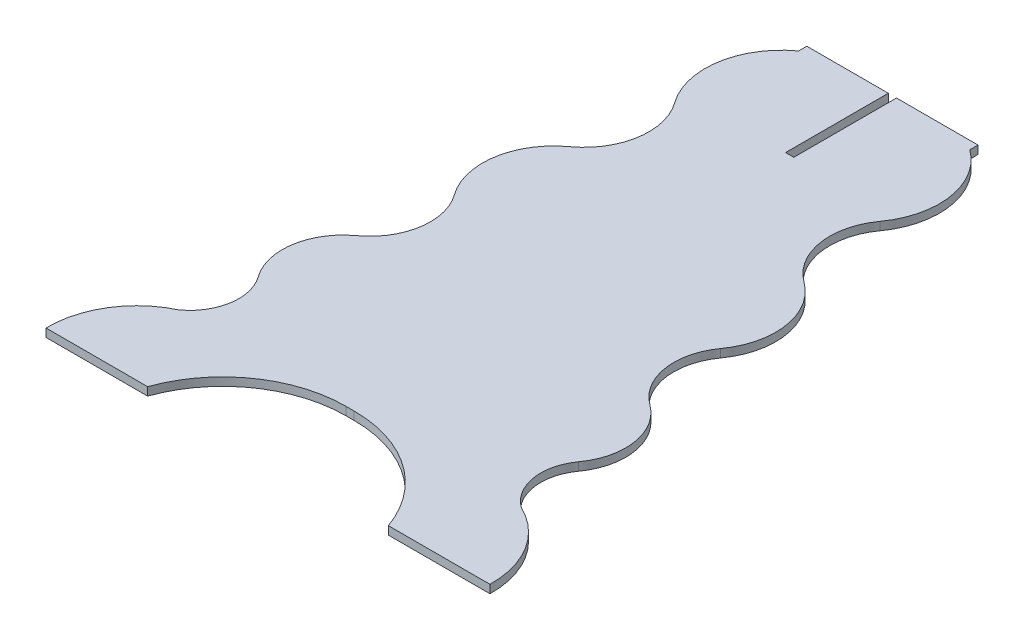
from build123d import *

# Parameters (mm, degrees)
BOSS_EXTRUDE1_DEPTH = 12
SKETCH2_W           = 12
SKETCH2_H           = 642
BOSS_EXTRUDE3_DEPTH = 12
SKETCH3_W           = 12
SKETCH3_H           = 150
CUT_EXTRUDE1_DEPTH  = 12


with BuildPart() as part:
    # Sketch1 → Boss-Extrude1 (new body)
    with BuildSketch(Plane(origin=(0, 0, 0), x_dir=(1, 0, 0), z_dir=(0, 1, 0))):
        with BuildLine():
            Line((6, 0), (6, 642))
            Line((6, 642), (-6, 642))
            Line((-6, 642), (-6, 0))
            ThreePointArc((-6, 0), (-109.965275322, -33.02760149), (-175.809051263, -120))
            Line((-175.809051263, -120), (-324.190948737, -120))
            ThreePointArc((-324.190948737, -120), (-304.755055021, -49.081824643), (-250, 0))
            ThreePointArc((-250, 0), (-221.324076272, 46.603663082), (-234.00090234, 99.8343694))
            ThreePointArc((-234.00090234, 99.8343694), (-249.721494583, 165.84602124), (-214.160345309, 223.639445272))
            ThreePointArc((-214.160345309, 223.639445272), (-178.815924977, 281.080644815), (-194.4407074, 346.689985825))
            ThreePointArc((-194.4407074, 346.689985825), (-212.852125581, 424.000567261), (-171.204127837, 491.686242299))
            ThreePointArc((-171.204127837, 491.686242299), (-133.187323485, 553.470558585), (-149.993492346, 624.040607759))
            ThreePointArc((-149.993492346, 624.040607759), (-169.796993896, 707.19662563), (-125, 780))
            Line((-125, 780), (-125, 792))
            Line((-125, 792), (125, 792))
            Line((125, 792), (125, 780))
            ThreePointArc((125, 780), (169.796993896, 707.19662563), (149.993492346, 624.040607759))
            ThreePointArc((149.993492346, 624.040607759), (133.187323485, 553.470558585), (171.204127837, 491.686242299))
            ThreePointArc((171.204127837, 491.686242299), (212.852125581, 424.000567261), (194.4407074, 346.689985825))
            ThreePointArc((194.4407074, 346.689985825), (178.815924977, 281.080644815), (214.160345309, 223.639445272))
            ThreePointArc((214.160345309, 223.639445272), (249.721494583, 165.84602124), (234.00090234, 99.8343694))
            ThreePointArc((234.00090234, 99.8343694), (221.324076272, 46.603663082), (250, 0))
            ThreePointArc((250, 0), (304.755055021, -49.081824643), (324.190948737, -120))
            Line((324.190948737, -120), (175.809051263, -120))
            ThreePointArc((175.809051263, -120), (109.965275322, -33.02760149), (6, 0))
        make_face()
    extrude(amount=BOSS_EXTRUDE1_DEPTH)

    # Sketch2 → Boss-Extrude3 (add)
    with BuildSketch(Plane(origin=(0, 12, 0), x_dir=(1, 0, 0), z_dir=(0, 1, 0))):
        with Locations((0, 321)):
            Rectangle(SKETCH2_W, SKETCH2_H)
    extrude(amount=-BOSS_EXTRUDE3_DEPTH)

    # Sketch3 → Cut-Extrude1 (cut)
    with BuildSketch(Plane(origin=(0, 12, 0), x_dir=(1, 0, 0), z_dir=(0, 1, 0))):
        with Locations((0, 717)):
            Rectangle(SKETCH3_W, SKETCH3_H)
    extrude(amount=-CUT_EXTRUDE1_DEPTH, mode=Mode.SUBTRACT)


solid = part.part
